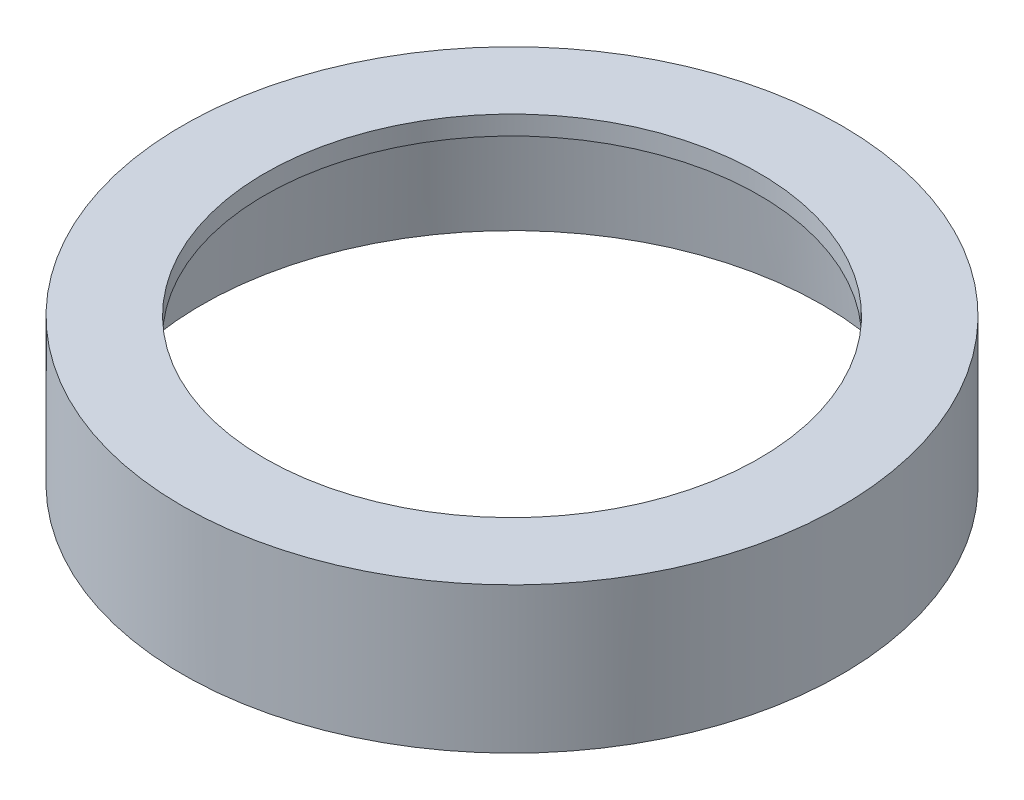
from build123d import *

# Parameters (mm, degrees)
SKETCH1_R           = 26
SKETCH1_R_2         = 19.5
BOSS_EXTRUDE1_DEPTH = 1.5
BOSS_EXTRUDE2_START = 10
SKETCH2_R           = 26
SKETCH2_R_2         = 23.75
BOSS_EXTRUDE2_DEPTH = 10
SKETCH3_R           = 24.5
SKETCH2_75_R        = 23.75


with BuildPart() as part:
    # Sketch1 → Boss-Extrude1 (new body)
    with BuildSketch(Plane(origin=(0, 0, 0), x_dir=(1, 0, 0), z_dir=(0, 1, 0))):
        with Locations(Location((0, 0, 0), (0, 0, 270))):
            Circle(SKETCH1_R)
        with Locations(Location((0, 0, 0), (0, 0, 270))):
            Circle(SKETCH1_R_2, mode=Mode.SUBTRACT)
    extrude(amount=BOSS_EXTRUDE1_DEPTH)

    # Sketch2 → Boss-Extrude2 (add)
    with BuildSketch(Plane.XZ.offset(BOSS_EXTRUDE2_START)):
        with Locations(Location((0, 0, 0), (0, 0, 270))):
            Circle(SKETCH2_R)
        with Locations(Location((0, 0, 0), (0, 0, 270))):
            Circle(SKETCH2_R_2, mode=Mode.SUBTRACT)
    extrude(amount=-BOSS_EXTRUDE2_DEPTH)

    # Sketch3 → Cut-Loft1 section 0
    with BuildSketch(Plane(origin=(0, -10, 0), x_dir=(-1, 0, 0), z_dir=(0, -1, 0))):
        Circle(SKETCH3_R)
    # Sketch2_75 → Cut-Loft1 section 1
    with BuildSketch(Plane.XZ):
        Circle(SKETCH2_75_R)
    loft(mode=Mode.SUBTRACT)


solid = part.part
